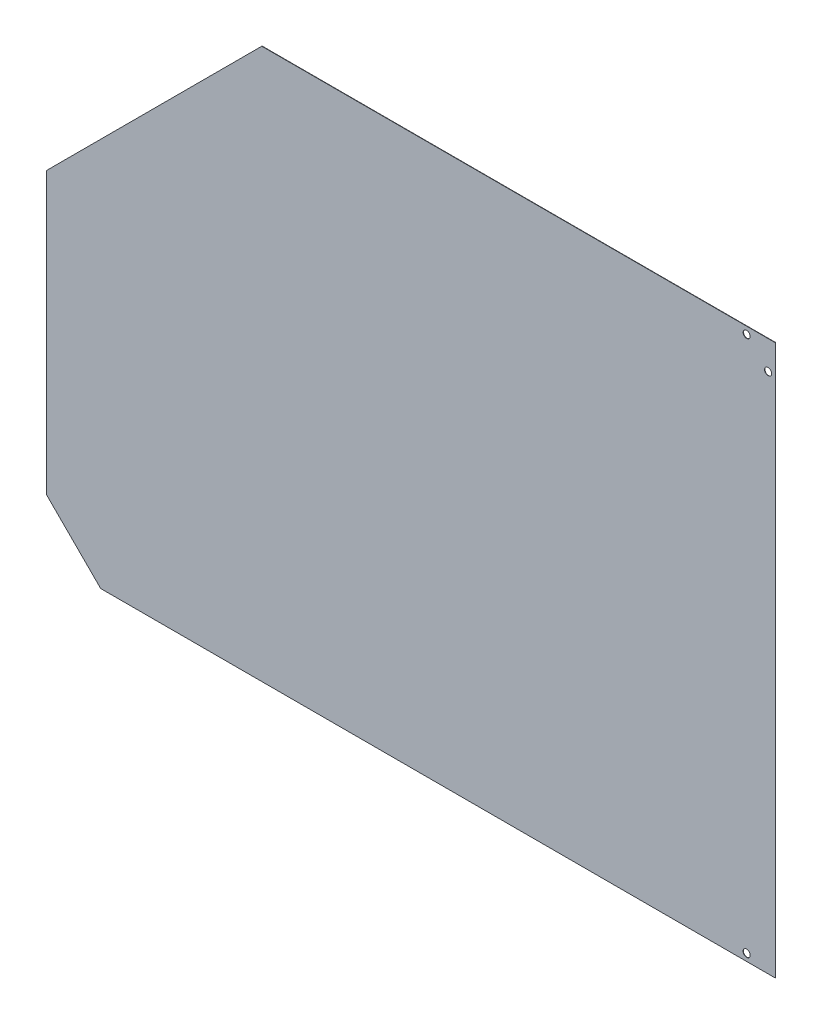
ISO-10303-21;
HEADER;
FILE_DESCRIPTION(('STEP AP214'),'2;1');
FILE_NAME('part.step','',(''),(''),'','','');
FILE_SCHEMA(('AUTOMOTIVE_DESIGN { 1 0 10303 214 1 1 1 1 }'));
ENDSEC;
DATA;
#1=APPLICATION_CONTEXT('core data for automotive mechanical design processes');
#2=APPLICATION_PROTOCOL_DEFINITION('international standard','automotive_design',2000,#1);
#3=PRODUCT_CONTEXT('',#1,'mechanical');
#4=PRODUCT('Part','Part','',(#3));
#5=PRODUCT_RELATED_PRODUCT_CATEGORY('part','',(#4));
#6=PRODUCT_DEFINITION_FORMATION('','',#4);
#7=PRODUCT_DEFINITION_CONTEXT('part definition',#1,'design');
#8=PRODUCT_DEFINITION('design','',#6,#7);
#9=PRODUCT_DEFINITION_SHAPE('','',#8);
#10=(LENGTH_UNIT() NAMED_UNIT(*) SI_UNIT(.MILLI.,.METRE.));
#11=(NAMED_UNIT(*) PLANE_ANGLE_UNIT() SI_UNIT($,.RADIAN.));
#12=(NAMED_UNIT(*) SI_UNIT($,.STERADIAN.) SOLID_ANGLE_UNIT());
#13=UNCERTAINTY_MEASURE_WITH_UNIT(LENGTH_MEASURE(1.E-05),#10,'distance_accuracy_value','');
#14=(GEOMETRIC_REPRESENTATION_CONTEXT(3) GLOBAL_UNCERTAINTY_ASSIGNED_CONTEXT((#13)) GLOBAL_UNIT_ASSIGNED_CONTEXT((#10,
#11,#12)) REPRESENTATION_CONTEXT('',''));
#15=CARTESIAN_POINT('',(0.,0.,0.));
#16=DIRECTION('',(0.,0.,1.));
#17=DIRECTION('',(1.,0.,0.));
#18=AXIS2_PLACEMENT_3D('',#15,#16,#17);
#19=CARTESIAN_POINT('',(-1.11022302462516E-13,0.,-0.500000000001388));
#20=DIRECTION('',(-1.,0.,0.));
#21=DIRECTION('',(0.,0.,-1.));
#22=AXIS2_PLACEMENT_3D('',#19,#20,#21);
#23=PLANE('',#22);
#24=DIRECTION('',(0.,0.999999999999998,0.));
#25=VECTOR('',#24,1.);
#26=CARTESIAN_POINT('',(-1.11022302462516E-13,0.,-1.33226762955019E-12));
#27=LINE('',#26,#25);
#28=CARTESIAN_POINT('',(-1.11022302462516E-13,0.,-1.33226762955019E-12));
#29=VERTEX_POINT('',#28);
#30=CARTESIAN_POINT('',(-2.22044604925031E-13,770.,-1.33226762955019E-12));
#31=VERTEX_POINT('',#30);
#32=EDGE_CURVE('E126',#29,#31,#27,.T.);
#33=ORIENTED_EDGE('',*,*,#32,.F.);
#34=DIRECTION('',(0.,0.,1.));
#35=VECTOR('',#34,1.);
#36=CARTESIAN_POINT('',(-1.11022302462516E-13,0.,-0.500000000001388));
#37=LINE('',#36,#35);
#38=CARTESIAN_POINT('',(-1.11022302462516E-13,0.,-0.500000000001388));
#39=VERTEX_POINT('',#38);
#40=EDGE_CURVE('E99',#39,#29,#37,.T.);
#41=ORIENTED_EDGE('',*,*,#40,.F.);
#42=DIRECTION('',(0.,0.999999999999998,0.));
#43=VECTOR('',#42,1.);
#44=CARTESIAN_POINT('',(-1.11022302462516E-13,0.,-0.500000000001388));
#45=LINE('',#44,#43);
#46=CARTESIAN_POINT('',(-2.22044604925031E-13,770.,-0.500000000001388));
#47=VERTEX_POINT('',#46);
#48=EDGE_CURVE('E101',#39,#47,#45,.T.);
#49=ORIENTED_EDGE('',*,*,#48,.T.);
#50=DIRECTION('',(0.,0.,1.));
#51=VECTOR('',#50,1.);
#52=CARTESIAN_POINT('',(-2.22044604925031E-13,770.,-0.500000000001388));
#53=LINE('',#52,#51);
#54=EDGE_CURVE('E11',#47,#31,#53,.T.);
#55=ORIENTED_EDGE('',*,*,#54,.T.);
#56=EDGE_LOOP('',(#33,#41,#49,#55));
#57=FACE_BOUND('',#56,.T.);
#58=ADVANCED_FACE('F28',(#57),#23,.F.);
#59=CARTESIAN_POINT('',(-2.22044604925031E-13,770.,-0.500000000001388));
#60=DIRECTION('',(0.,-0.999999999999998,0.));
#61=DIRECTION('',(1.,0.,0.));
#62=AXIS2_PLACEMENT_3D('',#59,#60,#61);
#63=PLANE('',#62);
#64=DIRECTION('',(-1.,0.,0.));
#65=VECTOR('',#64,1.);
#66=CARTESIAN_POINT('',(-2.22044604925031E-13,770.,-1.33226762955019E-12));
#67=LINE('',#66,#65);
#68=CARTESIAN_POINT('',(-718.580000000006,770.,0.));
#69=VERTEX_POINT('',#68);
#70=EDGE_CURVE('E130',#31,#69,#67,.T.);
#71=ORIENTED_EDGE('',*,*,#70,.F.);
#72=ORIENTED_EDGE('',*,*,#54,.F.);
#73=DIRECTION('',(-1.,0.,0.));
#74=VECTOR('',#73,1.);
#75=CARTESIAN_POINT('',(-2.22044604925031E-13,770.,-0.500000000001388));
#76=LINE('',#75,#74);
#77=CARTESIAN_POINT('',(-718.580000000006,770.,-0.500000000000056));
#78=VERTEX_POINT('',#77);
#79=EDGE_CURVE('E104',#47,#78,#76,.T.);
#80=ORIENTED_EDGE('',*,*,#79,.T.);
#81=DIRECTION('',(0.,0.,1.));
#82=VECTOR('',#81,1.);
#83=CARTESIAN_POINT('',(-718.580000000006,770.,-0.500000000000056));
#84=LINE('',#83,#82);
#85=EDGE_CURVE('E36',#78,#69,#84,.T.);
#86=ORIENTED_EDGE('',*,*,#85,.T.);
#87=EDGE_LOOP('',(#71,#72,#80,#86));
#88=FACE_BOUND('',#87,.T.);
#89=ADVANCED_FACE('F147',(#88),#63,.F.);
#90=CARTESIAN_POINT('',(-718.580000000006,770.,-0.500000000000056));
#91=DIRECTION('',(0.707106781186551,-0.707106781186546,0.));
#92=DIRECTION('',(0.707106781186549,0.707106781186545,0.));
#93=AXIS2_PLACEMENT_3D('',#90,#91,#92);
#94=PLANE('',#93);
#95=DIRECTION('',(-0.707106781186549,-0.707106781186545,0.));
#96=VECTOR('',#95,1.);
#97=CARTESIAN_POINT('',(-718.580000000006,770.,0.));
#98=LINE('',#97,#96);
#99=CARTESIAN_POINT('',(-1020.00000000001,468.580000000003,-2.77555756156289E-12));
#100=VERTEX_POINT('',#99);
#101=EDGE_CURVE('E106',#69,#100,#98,.T.);
#102=ORIENTED_EDGE('',*,*,#101,.F.);
#103=ORIENTED_EDGE('',*,*,#85,.F.);
#104=DIRECTION('',(-0.707106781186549,-0.707106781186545,0.));
#105=VECTOR('',#104,1.);
#106=CARTESIAN_POINT('',(-718.580000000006,770.,-0.500000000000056));
#107=LINE('',#106,#105);
#108=CARTESIAN_POINT('',(-1020.00000000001,468.580000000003,-0.500000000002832));
#109=VERTEX_POINT('',#108);
#110=EDGE_CURVE('E112',#78,#109,#107,.T.);
#111=ORIENTED_EDGE('',*,*,#110,.T.);
#112=DIRECTION('',(0.,0.,1.));
#113=VECTOR('',#112,1.);
#114=CARTESIAN_POINT('',(-1020.00000000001,468.580000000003,-0.500000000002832));
#115=LINE('',#114,#113);
#116=EDGE_CURVE('E120',#109,#100,#115,.T.);
#117=ORIENTED_EDGE('',*,*,#116,.T.);
#118=EDGE_LOOP('',(#102,#103,#111,#117));
#119=FACE_BOUND('',#118,.T.);
#120=ADVANCED_FACE('F144',(#119),#94,.F.);
#121=CARTESIAN_POINT('',(-1020.,1.55431223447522E-12,-0.500000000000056));
#122=DIRECTION('',(1.,0.,0.));
#123=DIRECTION('',(0.,0.,1.));
#124=AXIS2_PLACEMENT_3D('',#121,#122,#123);
#125=PLANE('',#124);
#126=DIRECTION('',(0.,-0.999999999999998,0.));
#127=VECTOR('',#126,1.);
#128=CARTESIAN_POINT('',(-1020.,1.55431223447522E-12,0.));
#129=LINE('',#128,#127);
#130=CARTESIAN_POINT('',(-1020.00000000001,75.9628949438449,-1.4432899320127E-12));
#131=VERTEX_POINT('',#130);
#132=EDGE_CURVE('E89',#100,#131,#129,.T.);
#133=ORIENTED_EDGE('',*,*,#132,.F.);
#134=ORIENTED_EDGE('',*,*,#116,.F.);
#135=DIRECTION('',(0.,-0.999999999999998,0.));
#136=VECTOR('',#135,1.);
#137=CARTESIAN_POINT('',(-1020.,1.55431223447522E-12,-0.500000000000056));
#138=LINE('',#137,#136);
#139=CARTESIAN_POINT('',(-1020.00000000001,75.9628949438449,-0.500000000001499));
#140=VERTEX_POINT('',#139);
#141=EDGE_CURVE('E115',#109,#140,#138,.T.);
#142=ORIENTED_EDGE('',*,*,#141,.T.);
#143=DIRECTION('',(0.,0.,1.));
#144=VECTOR('',#143,1.);
#145=CARTESIAN_POINT('',(-1020.00000000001,75.9628949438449,-10.0000000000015));
#146=LINE('',#145,#144);
#147=EDGE_CURVE('E90',#140,#131,#146,.T.);
#148=ORIENTED_EDGE('',*,*,#147,.T.);
#149=EDGE_LOOP('',(#133,#134,#142,#148));
#150=FACE_BOUND('',#149,.T.);
#151=ADVANCED_FACE('F153',(#150),#125,.F.);
#152=CARTESIAN_POINT('',(-1.11022302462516E-13,0.,-0.500000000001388));
#153=DIRECTION('',(0.,0.999999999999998,0.));
#154=DIRECTION('',(-1.,0.,0.));
#155=AXIS2_PLACEMENT_3D('',#152,#153,#154);
#156=PLANE('',#155);
#157=DIRECTION('',(1.,0.,0.));
#158=VECTOR('',#157,1.);
#159=CARTESIAN_POINT('',(-1.11022302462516E-13,0.,-0.500000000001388));
#160=LINE('',#159,#158);
#161=CARTESIAN_POINT('',(-944.037105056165,2.44249065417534E-12,-0.500000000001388));
#162=VERTEX_POINT('',#161);
#163=EDGE_CURVE('E52',#162,#39,#160,.T.);
#164=ORIENTED_EDGE('',*,*,#163,.T.);
#165=ORIENTED_EDGE('',*,*,#40,.T.);
#166=DIRECTION('',(1.,0.,0.));
#167=VECTOR('',#166,1.);
#168=CARTESIAN_POINT('',(-1.11022302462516E-13,0.,-1.33226762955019E-12));
#169=LINE('',#168,#167);
#170=CARTESIAN_POINT('',(-944.037105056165,2.44249065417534E-12,-1.4432899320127E-12));
#171=VERTEX_POINT('',#170);
#172=EDGE_CURVE('E87',#171,#29,#169,.T.);
#173=ORIENTED_EDGE('',*,*,#172,.F.);
#174=DIRECTION('',(0.,0.,1.));
#175=VECTOR('',#174,1.);
#176=CARTESIAN_POINT('',(-944.037105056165,1.99840144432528E-12,-10.0000000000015));
#177=LINE('',#176,#175);
#178=EDGE_CURVE('E93',#162,#171,#177,.T.);
#179=ORIENTED_EDGE('',*,*,#178,.F.);
#180=EDGE_LOOP('',(#164,#165,#173,#179));
#181=FACE_BOUND('',#180,.T.);
#182=ADVANCED_FACE('F97',(#181),#156,.F.);
#183=CARTESIAN_POINT('',(-1.11022302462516E-13,0.,-0.500000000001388));
#184=DIRECTION('',(0.,0.,-1.));
#185=DIRECTION('',(1.,0.,0.));
#186=AXIS2_PLACEMENT_3D('',#183,#184,#185);
#187=PLANE('',#186);
#188=CARTESIAN_POINT('',(-40.0000000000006,9.9999999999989,-0.500000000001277));
#189=DIRECTION('',(0.,0.,1.));
#190=DIRECTION('',(1.,0.,0.));
#191=AXIS2_PLACEMENT_3D('',#188,#189,#190);
#192=CIRCLE('',#191,5.0000000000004);
#193=CARTESIAN_POINT('',(-35.0000000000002,9.99999999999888,-0.500000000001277));
#194=VERTEX_POINT('',#193);
#195=EDGE_CURVE('E91',#194,#194,#192,.T.);
#196=ORIENTED_EDGE('',*,*,#195,.T.);
#197=EDGE_LOOP('',(#196));
#198=FACE_BOUND('',#197,.T.);
#199=DIRECTION('',(-0.707106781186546,0.707106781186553,0.));
#200=VECTOR('',#199,1.);
#201=CARTESIAN_POINT('',(-472.018552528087,-472.018552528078,-0.500000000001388));
#202=LINE('',#201,#200);
#203=EDGE_CURVE('E95',#162,#140,#202,.T.);
#204=ORIENTED_EDGE('',*,*,#203,.T.);
#205=ORIENTED_EDGE('',*,*,#141,.F.);
#206=ORIENTED_EDGE('',*,*,#110,.F.);
#207=ORIENTED_EDGE('',*,*,#79,.F.);
#208=ORIENTED_EDGE('',*,*,#48,.F.);
#209=ORIENTED_EDGE('',*,*,#163,.F.);
#210=EDGE_LOOP('',(#204,#205,#206,#207,#208,#209));
#211=FACE_BOUND('',#210,.T.);
#212=CARTESIAN_POINT('',(-10.0000000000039,729.999999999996,-0.500000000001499));
#213=DIRECTION('',(0.,0.,1.));
#214=DIRECTION('',(1.,0.,0.));
#215=AXIS2_PLACEMENT_3D('',#212,#213,#214);
#216=CIRCLE('',#215,4.97314944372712);
#217=CARTESIAN_POINT('',(-5.02685055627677,729.999999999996,-0.500000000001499));
#218=VERTEX_POINT('',#217);
#219=EDGE_CURVE('E137',#218,#218,#216,.T.);
#220=ORIENTED_EDGE('',*,*,#219,.T.);
#221=EDGE_LOOP('',(#220));
#222=FACE_BOUND('',#221,.T.);
#223=CARTESIAN_POINT('',(-40.0000000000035,759.999999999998,-0.500000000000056));
#224=DIRECTION('',(0.,0.,1.));
#225=DIRECTION('',(1.,0.,0.));
#226=AXIS2_PLACEMENT_3D('',#223,#224,#225);
#227=CIRCLE('',#226,4.90359405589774);
#228=CARTESIAN_POINT('',(-35.0964059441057,759.999999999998,-0.500000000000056));
#229=VERTEX_POINT('',#228);
#230=EDGE_CURVE('E127',#229,#229,#227,.T.);
#231=ORIENTED_EDGE('',*,*,#230,.T.);
#232=EDGE_LOOP('',(#231));
#233=FACE_BOUND('',#232,.T.);
#234=ADVANCED_FACE('F150',(#198,#211,#222,#233),#187,.T.);
#235=CARTESIAN_POINT('',(-1.11022302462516E-13,0.,-1.33226762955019E-12));
#236=DIRECTION('',(0.,0.,-1.));
#237=DIRECTION('',(1.,0.,0.));
#238=AXIS2_PLACEMENT_3D('',#235,#236,#237);
#239=PLANE('',#238);
#240=CARTESIAN_POINT('',(-40.0000000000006,9.9999999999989,-1.33226762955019E-12));
#241=DIRECTION('',(0.,0.,-1.));
#242=DIRECTION('',(-1.,0.,0.));
#243=AXIS2_PLACEMENT_3D('',#240,#241,#242);
#244=CIRCLE('',#243,5.0000000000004);
#245=CARTESIAN_POINT('',(-45.000000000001,9.99999999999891,-1.33257172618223E-12));
#246=VERTEX_POINT('',#245);
#247=EDGE_CURVE('E229',#246,#246,#244,.T.);
#248=ORIENTED_EDGE('',*,*,#247,.T.);
#249=EDGE_LOOP('',(#248));
#250=FACE_BOUND('',#249,.T.);
#251=CARTESIAN_POINT('',(-10.0000000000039,729.999999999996,-1.4432899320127E-12));
#252=DIRECTION('',(0.,0.,1.));
#253=DIRECTION('',(1.,0.,0.));
#254=AXIS2_PLACEMENT_3D('',#251,#252,#253);
#255=CIRCLE('',#254,4.97314944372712);
#256=CARTESIAN_POINT('',(-5.02685055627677,729.999999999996,-1.44298746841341E-12));
#257=VERTEX_POINT('',#256);
#258=EDGE_CURVE('E31',#257,#257,#255,.T.);
#259=ORIENTED_EDGE('',*,*,#258,.F.);
#260=EDGE_LOOP('',(#259));
#261=FACE_BOUND('',#260,.T.);
#262=CARTESIAN_POINT('',(-40.0000000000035,759.999999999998,-1.11022302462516E-13));
#263=DIRECTION('',(0.,0.,1.));
#264=DIRECTION('',(1.,0.,0.));
#265=AXIS2_PLACEMENT_3D('',#262,#263,#264);
#266=CIRCLE('',#265,4.90359405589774);
#267=CARTESIAN_POINT('',(-35.0964059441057,759.999999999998,-1.10724069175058E-13));
#268=VERTEX_POINT('',#267);
#269=EDGE_CURVE('E124',#268,#268,#266,.T.);
#270=ORIENTED_EDGE('',*,*,#269,.F.);
#271=EDGE_LOOP('',(#270));
#272=FACE_BOUND('',#271,.T.);
#273=ORIENTED_EDGE('',*,*,#172,.T.);
#274=ORIENTED_EDGE('',*,*,#32,.T.);
#275=ORIENTED_EDGE('',*,*,#70,.T.);
#276=ORIENTED_EDGE('',*,*,#101,.T.);
#277=ORIENTED_EDGE('',*,*,#132,.T.);
#278=DIRECTION('',(0.707106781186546,-0.707106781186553,0.));
#279=VECTOR('',#278,1.);
#280=CARTESIAN_POINT('',(-1020.00000000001,75.9628949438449,-1.4432899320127E-12));
#281=LINE('',#280,#279);
#282=EDGE_CURVE('E44',#131,#171,#281,.T.);
#283=ORIENTED_EDGE('',*,*,#282,.T.);
#284=EDGE_LOOP('',(#273,#274,#275,#276,#277,#283));
#285=FACE_BOUND('',#284,.T.);
#286=ADVANCED_FACE('F84',(#250,#261,#272,#285),#239,.F.);
#287=CARTESIAN_POINT('',(-40.0000000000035,759.999999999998,9.49999999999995));
#288=DIRECTION('',(0.,0.,-1.));
#289=DIRECTION('',(1.,0.,0.));
#290=AXIS2_PLACEMENT_3D('',#287,#288,#289);
#291=CYLINDRICAL_SURFACE('',#290,4.90359405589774);
#292=ORIENTED_EDGE('',*,*,#230,.F.);
#293=EDGE_LOOP('',(#292));
#294=FACE_BOUND('',#293,.T.);
#295=ORIENTED_EDGE('',*,*,#269,.T.);
#296=EDGE_LOOP('',(#295));
#297=FACE_BOUND('',#296,.T.);
#298=ADVANCED_FACE('F161',(#294,#297),#291,.F.);
#299=CARTESIAN_POINT('',(-10.0000000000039,729.999999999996,9.49999999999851));
#300=DIRECTION('',(0.,0.,-1.));
#301=DIRECTION('',(1.,0.,0.));
#302=AXIS2_PLACEMENT_3D('',#299,#300,#301);
#303=CYLINDRICAL_SURFACE('',#302,4.97314944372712);
#304=ORIENTED_EDGE('',*,*,#219,.F.);
#305=EDGE_LOOP('',(#304));
#306=FACE_BOUND('',#305,.T.);
#307=ORIENTED_EDGE('',*,*,#258,.T.);
#308=EDGE_LOOP('',(#307));
#309=FACE_BOUND('',#308,.T.);
#310=ADVANCED_FACE('F158',(#306,#309),#303,.F.);
#311=CARTESIAN_POINT('',(-1020.00000000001,75.9628949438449,-10.0000000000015));
#312=DIRECTION('',(0.707106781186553,0.707106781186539,0.));
#313=DIRECTION('',(-0.707106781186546,0.707106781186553,0.));
#314=AXIS2_PLACEMENT_3D('',#311,#312,#313);
#315=PLANE('',#314);
#316=ORIENTED_EDGE('',*,*,#203,.F.);
#317=ORIENTED_EDGE('',*,*,#178,.T.);
#318=ORIENTED_EDGE('',*,*,#282,.F.);
#319=ORIENTED_EDGE('',*,*,#147,.F.);
#320=EDGE_LOOP('',(#316,#317,#318,#319));
#321=FACE_BOUND('',#320,.T.);
#322=ADVANCED_FACE('F94',(#321),#315,.F.);
#323=CARTESIAN_POINT('',(-39.9999999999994,10.0000000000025,-401.000000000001));
#324=DIRECTION('',(0.,0.,1.));
#325=DIRECTION('',(-1.,0.,0.));
#326=AXIS2_PLACEMENT_3D('',#323,#324,#325);
#327=CYLINDRICAL_SURFACE('',#326,5.0000000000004);
#328=ORIENTED_EDGE('',*,*,#195,.F.);
#329=EDGE_LOOP('',(#328));
#330=FACE_BOUND('',#329,.T.);
#331=ORIENTED_EDGE('',*,*,#247,.F.);
#332=EDGE_LOOP('',(#331));
#333=FACE_BOUND('',#332,.T.);
#334=ADVANCED_FACE('F216',(#330,#333),#327,.F.);
#335=CLOSED_SHELL('',(#58,#89,#120,#151,#182,#234,#286,#298,#310,#322,#334));
#336=MANIFOLD_SOLID_BREP('B2',#335);
#337=ADVANCED_BREP_SHAPE_REPRESENTATION('',(#18,#336),#14);
#338=SHAPE_DEFINITION_REPRESENTATION(#9,#337);
ENDSEC;
END-ISO-10303-21;
